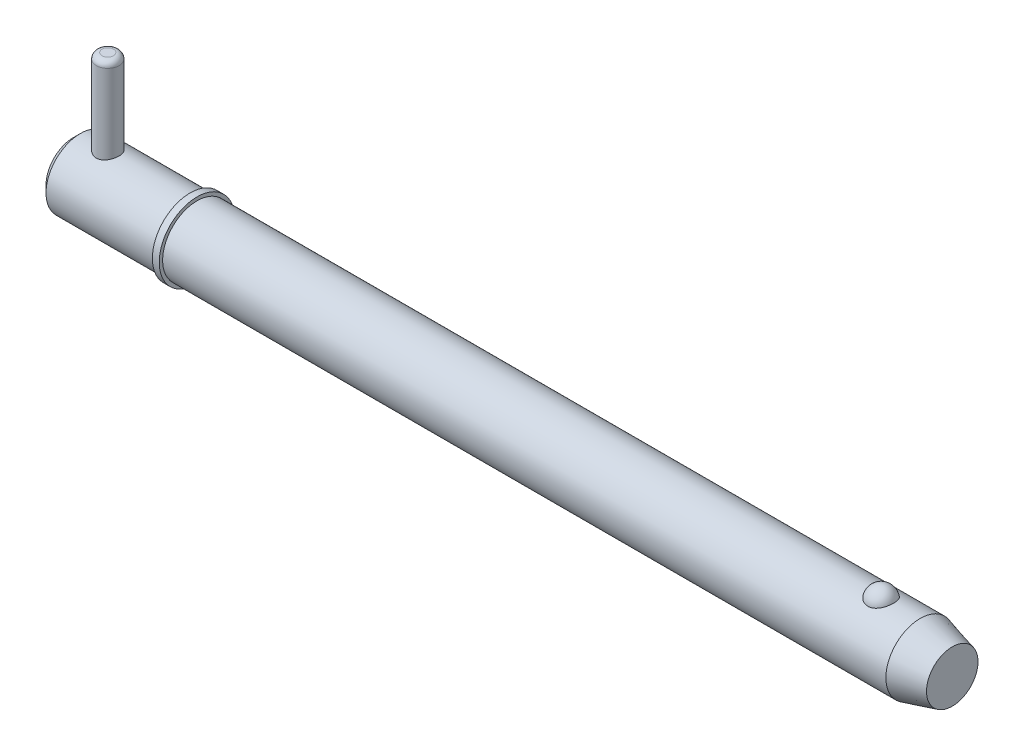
ISO-10303-21;
HEADER;
FILE_DESCRIPTION(('STEP AP214'),'2;1');
FILE_NAME('part.step','',(''),(''),'','','');
FILE_SCHEMA(('AUTOMOTIVE_DESIGN { 1 0 10303 214 1 1 1 1 }'));
ENDSEC;
DATA;
#1=APPLICATION_CONTEXT('core data for automotive mechanical design processes');
#2=APPLICATION_PROTOCOL_DEFINITION('international standard','automotive_design',2000,#1);
#3=PRODUCT_CONTEXT('',#1,'mechanical');
#4=PRODUCT('Part','Part','',(#3));
#5=PRODUCT_RELATED_PRODUCT_CATEGORY('part','',(#4));
#6=PRODUCT_DEFINITION_FORMATION('','',#4);
#7=PRODUCT_DEFINITION_CONTEXT('part definition',#1,'design');
#8=PRODUCT_DEFINITION('design','',#6,#7);
#9=PRODUCT_DEFINITION_SHAPE('','',#8);
#10=(LENGTH_UNIT() NAMED_UNIT(*) SI_UNIT(.MILLI.,.METRE.));
#11=(NAMED_UNIT(*) PLANE_ANGLE_UNIT() SI_UNIT($,.RADIAN.));
#12=(NAMED_UNIT(*) SI_UNIT($,.STERADIAN.) SOLID_ANGLE_UNIT());
#13=UNCERTAINTY_MEASURE_WITH_UNIT(LENGTH_MEASURE(1.E-05),#10,'distance_accuracy_value','');
#14=(GEOMETRIC_REPRESENTATION_CONTEXT(3) GLOBAL_UNCERTAINTY_ASSIGNED_CONTEXT((#13)) GLOBAL_UNIT_ASSIGNED_CONTEXT((#10,
#11,#12)) REPRESENTATION_CONTEXT('',''));
#15=CARTESIAN_POINT('',(0.,0.,0.));
#16=DIRECTION('',(0.,0.,1.));
#17=DIRECTION('',(1.,0.,0.));
#18=AXIS2_PLACEMENT_3D('',#15,#16,#17);
#19=CARTESIAN_POINT('',(7.14,24.605,0.));
#20=DIRECTION('',(0.,-1.,0.));
#21=DIRECTION('',(0.,0.,-1.));
#22=AXIS2_PLACEMENT_3D('',#19,#20,#21);
#23=CYLINDRICAL_SURFACE('',#22,2.38);
#24=CARTESIAN_POINT('',(7.14,-5.955,0.));
#25=DIRECTION('',(0.,1.,0.));
#26=DIRECTION('',(0.,0.,1.));
#27=AXIS2_PLACEMENT_3D('',#24,#25,#26);
#28=CIRCLE('',#27,2.38);
#29=CARTESIAN_POINT('',(7.14,-5.955,2.38));
#30=VERTEX_POINT('',#29);
#31=EDGE_CURVE('P0_E25',#30,#30,#28,.T.);
#32=ORIENTED_EDGE('',*,*,#31,.T.);
#33=EDGE_LOOP('',(#32));
#34=FACE_BOUND('',#33,.T.);
#35=CARTESIAN_POINT('',(7.14,23.415,0.));
#36=DIRECTION('',(0.,1.,0.));
#37=DIRECTION('',(0.,0.,1.));
#38=AXIS2_PLACEMENT_3D('',#35,#36,#37);
#39=CIRCLE('',#38,2.38);
#40=CARTESIAN_POINT('',(7.14,23.415,2.38));
#41=VERTEX_POINT('',#40);
#42=EDGE_CURVE('P0_E29',#41,#41,#39,.F.);
#43=ORIENTED_EDGE('',*,*,#42,.T.);
#44=EDGE_LOOP('',(#43));
#45=FACE_BOUND('',#44,.T.);
#46=ADVANCED_FACE('P0_F14',(#34,#45),#23,.T.);
#47=CARTESIAN_POINT('',(7.14,24.605,0.));
#48=DIRECTION('',(0.,1.,0.));
#49=DIRECTION('',(0.,0.,1.));
#50=AXIS2_PLACEMENT_3D('',#47,#48,#49);
#51=PLANE('',#50);
#52=CARTESIAN_POINT('',(7.14,24.605,0.));
#53=DIRECTION('',(0.,1.,0.));
#54=DIRECTION('',(0.,0.,1.));
#55=AXIS2_PLACEMENT_3D('',#52,#53,#54);
#56=CIRCLE('',#55,1.19);
#57=CARTESIAN_POINT('',(7.14,24.605,1.19));
#58=VERTEX_POINT('',#57);
#59=EDGE_CURVE('P0_E10',#58,#58,#56,.T.);
#60=ORIENTED_EDGE('',*,*,#59,.T.);
#61=EDGE_LOOP('',(#60));
#62=FACE_BOUND('',#61,.T.);
#63=ADVANCED_FACE('P0_F46',(#62),#51,.T.);
#64=CARTESIAN_POINT('',(7.14,-7.145,0.));
#65=DIRECTION('',(0.,1.,0.));
#66=DIRECTION('',(0.,0.,1.));
#67=AXIS2_PLACEMENT_3D('',#64,#65,#66);
#68=PLANE('',#67);
#69=CARTESIAN_POINT('',(7.14,-7.145,0.));
#70=DIRECTION('',(0.,1.,0.));
#71=DIRECTION('',(0.,0.,1.));
#72=AXIS2_PLACEMENT_3D('',#69,#70,#71);
#73=CIRCLE('',#72,1.19);
#74=CARTESIAN_POINT('',(7.14,-7.145,1.19));
#75=VERTEX_POINT('',#74);
#76=EDGE_CURVE('P0_E21',#75,#75,#73,.F.);
#77=ORIENTED_EDGE('',*,*,#76,.T.);
#78=EDGE_LOOP('',(#77));
#79=FACE_BOUND('',#78,.T.);
#80=ADVANCED_FACE('P0_F43',(#79),#68,.F.);
#81=CARTESIAN_POINT('',(7.14,-5.955,0.));
#82=DIRECTION('',(0.,1.,0.));
#83=DIRECTION('',(0.,0.,1.));
#84=AXIS2_PLACEMENT_3D('',#81,#82,#83);
#85=DEGENERATE_TOROIDAL_SURFACE('',#84,1.19,1.19,.T.);
#86=ORIENTED_EDGE('',*,*,#76,.F.);
#87=EDGE_LOOP('',(#86));
#88=FACE_BOUND('',#87,.T.);
#89=ORIENTED_EDGE('',*,*,#31,.F.);
#90=EDGE_LOOP('',(#89));
#91=FACE_BOUND('',#90,.T.);
#92=ADVANCED_FACE('P0_F38',(#88,#91),#85,.T.);
#93=CARTESIAN_POINT('',(7.14,23.415,0.));
#94=DIRECTION('',(0.,1.,0.));
#95=DIRECTION('',(0.,0.,1.));
#96=AXIS2_PLACEMENT_3D('',#93,#94,#95);
#97=DEGENERATE_TOROIDAL_SURFACE('',#96,1.19,1.19,.T.);
#98=ORIENTED_EDGE('',*,*,#42,.F.);
#99=EDGE_LOOP('',(#98));
#100=FACE_BOUND('',#99,.T.);
#101=ORIENTED_EDGE('',*,*,#59,.F.);
#102=EDGE_LOOP('',(#101));
#103=FACE_BOUND('',#102,.T.);
#104=ADVANCED_FACE('P0_F16',(#100,#103),#97,.T.);
#105=CLOSED_SHELL('',(#46,#63,#80,#92,#104));
#106=MANIFOLD_SOLID_BREP('P0_B1',#105);
#107=CARTESIAN_POINT('',(0.,0.,0.));
#108=DIRECTION('',(1.,0.,0.));
#109=DIRECTION('',(0.,0.,-1.));
#110=AXIS2_PLACEMENT_3D('',#107,#108,#109);
#111=CYLINDRICAL_SURFACE('',#110,7.145);
#112=CARTESIAN_POINT('',(176.18362424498,0.,0.));
#113=DIRECTION('',(1.,0.,0.));
#114=DIRECTION('',(0.,0.,-1.));
#115=AXIS2_PLACEMENT_3D('',#112,#113,#114);
#116=CIRCLE('',#115,7.145);
#117=CARTESIAN_POINT('',(176.18362424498,0.,-7.145));
#118=VERTEX_POINT('',#117);
#119=EDGE_CURVE('P1_E81',#118,#118,#116,.T.);
#120=ORIENTED_EDGE('',*,*,#119,.F.);
#121=EDGE_LOOP('',(#120));
#122=FACE_BOUND('',#121,.T.);
#123=CARTESIAN_POINT('',(25.7,0.,0.));
#124=DIRECTION('',(1.,0.,0.));
#125=DIRECTION('',(0.,0.,-1.));
#126=AXIS2_PLACEMENT_3D('',#123,#124,#125);
#127=CIRCLE('',#126,7.145);
#128=CARTESIAN_POINT('',(25.7,0.,-7.145));
#129=VERTEX_POINT('',#128);
#130=EDGE_CURVE('P1_E85',#129,#129,#127,.T.);
#131=ORIENTED_EDGE('',*,*,#130,.T.);
#132=EDGE_LOOP('',(#131));
#133=FACE_BOUND('',#132,.T.);
#134=CARTESIAN_POINT('',(168.039503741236,6.60328629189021,2.72903557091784));
#135=CARTESIAN_POINT('',(167.898315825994,6.60329644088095,2.7290249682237));
#136=CARTESIAN_POINT('',(167.756883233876,6.60799490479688,2.71772840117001));
#137=CARTESIAN_POINT('',(167.477955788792,6.62628236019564,2.6728193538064));
#138=CARTESIAN_POINT('',(167.340472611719,6.63989534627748,2.63914664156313));
#139=CARTESIAN_POINT('',(167.073889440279,6.67440775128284,2.55059642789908));
#140=CARTESIAN_POINT('',(166.944768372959,6.69528793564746,2.49577486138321));
#141=CARTESIAN_POINT('',(166.697869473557,6.74205585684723,2.36651799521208));
#142=CARTESIAN_POINT('',(166.580086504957,6.76794130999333,2.2920916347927));
#143=CARTESIAN_POINT('',(166.35516710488,6.82286177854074,2.12312937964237));
#144=CARTESIAN_POINT('',(166.248440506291,6.85196655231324,2.0280710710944));
#145=CARTESIAN_POINT('',(166.051918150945,6.90970232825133,1.82167822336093));
#146=CARTESIAN_POINT('',(165.962127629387,6.93833318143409,1.71033867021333));
#147=CARTESIAN_POINT('',(165.797667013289,6.9935167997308,1.46891951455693));
#148=CARTESIAN_POINT('',(165.723844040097,7.01992110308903,1.33822781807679));
#149=CARTESIAN_POINT('',(165.598088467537,7.06643385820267,1.0656656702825));
#150=CARTESIAN_POINT('',(165.54615735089,7.08654188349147,0.923794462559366));
#151=CARTESIAN_POINT('',(165.464732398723,7.11862399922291,0.630993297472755));
#152=CARTESIAN_POINT('',(165.435516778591,7.13049704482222,0.479974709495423));
#153=CARTESIAN_POINT('',(165.401174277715,7.14449484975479,0.174782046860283));
#154=CARTESIAN_POINT('',(165.396046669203,7.14661990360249,0.020608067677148));
#155=CARTESIAN_POINT('',(165.409938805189,7.14092465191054,-0.285506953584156));
#156=CARTESIAN_POINT('',(165.428810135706,7.1331654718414,-0.437455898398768));
#157=CARTESIAN_POINT('',(165.490062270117,7.10859076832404,-0.73577860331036));
#158=CARTESIAN_POINT('',(165.532443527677,7.0917750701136,-0.882152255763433));
#159=CARTESIAN_POINT('',(165.639934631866,7.05076716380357,-1.16543149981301));
#160=CARTESIAN_POINT('',(165.705075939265,7.02656475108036,-1.30232366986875));
#161=CARTESIAN_POINT('',(165.856759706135,6.97329145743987,-1.56265907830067));
#162=CARTESIAN_POINT('',(165.943303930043,6.94422017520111,-1.68610120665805));
#163=CARTESIAN_POINT('',(166.136465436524,6.88415108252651,-1.91671004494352));
#164=CARTESIAN_POINT('',(166.243180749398,6.85314438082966,-2.02379244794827));
#165=CARTESIAN_POINT('',(166.473974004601,6.79282069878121,-2.21787433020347));
#166=CARTESIAN_POINT('',(166.598050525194,6.76350358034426,-2.30487545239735));
#167=CARTESIAN_POINT('',(166.857678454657,6.71060580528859,-2.45458647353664));
#168=CARTESIAN_POINT('',(166.992938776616,6.68691885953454,-2.51776240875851));
#169=CARTESIAN_POINT('',(167.273277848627,6.64741247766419,-2.62030218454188));
#170=CARTESIAN_POINT('',(167.418352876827,6.63159007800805,-2.65967499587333));
#171=CARTESIAN_POINT('',(167.706347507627,6.61038594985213,-2.71193301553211));
#172=CARTESIAN_POINT('',(167.84900807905,6.60451880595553,-2.72605165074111));
#173=CARTESIAN_POINT('',(168.13480047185,6.60240611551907,-2.73116688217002));
#174=CARTESIAN_POINT('',(168.277932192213,6.60615862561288,-2.7221681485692));
#175=CARTESIAN_POINT('',(168.555848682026,6.62256094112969,-2.68200435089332));
#176=CARTESIAN_POINT('',(168.690754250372,6.63492533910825,-2.65154998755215));
#177=CARTESIAN_POINT('',(168.95332009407,6.66687445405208,-2.57015684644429));
#178=CARTESIAN_POINT('',(169.08097978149,6.68645975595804,-2.51921640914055));
#179=CARTESIAN_POINT('',(169.328577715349,6.73127274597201,-2.39693610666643));
#180=CARTESIAN_POINT('',(169.448287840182,6.7566138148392,-2.32517694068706));
#181=CARTESIAN_POINT('',(169.674159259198,6.8100600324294,-2.16363812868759));
#182=CARTESIAN_POINT('',(169.780317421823,6.83816581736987,-2.07385432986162));
#183=CARTESIAN_POINT('',(169.981862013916,6.89580469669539,-1.87357235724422));
#184=CARTESIAN_POINT('',(170.076440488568,6.92533863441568,-1.76226074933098));
#185=CARTESIAN_POINT('',(170.246332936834,6.98139526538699,-1.5251169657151));
#186=CARTESIAN_POINT('',(170.321643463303,7.0079174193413,-1.39928219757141));
#187=CARTESIAN_POINT('',(170.453595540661,7.05607625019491,-1.1321597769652));
#188=CARTESIAN_POINT('',(170.509568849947,7.07753119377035,-0.990508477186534));
#189=CARTESIAN_POINT('',(170.598296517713,7.11222355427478,-0.699154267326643));
#190=CARTESIAN_POINT('',(170.631050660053,7.12546089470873,-0.549451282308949));
#191=CARTESIAN_POINT('',(170.672689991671,7.14237584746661,-0.246120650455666));
#192=CARTESIAN_POINT('',(170.681558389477,7.14604673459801,-0.0924903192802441));
#193=CARTESIAN_POINT('',(170.675194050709,7.14343510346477,0.214181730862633));
#194=CARTESIAN_POINT('',(170.659961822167,7.13715279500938,0.367223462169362));
#195=CARTESIAN_POINT('',(170.605845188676,7.1153294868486,0.667595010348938));
#196=CARTESIAN_POINT('',(170.567077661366,7.09983424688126,0.814949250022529));
#197=CARTESIAN_POINT('',(170.466770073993,7.06119140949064,1.1006322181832));
#198=CARTESIAN_POINT('',(170.405228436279,7.03804328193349,1.23896032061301));
#199=CARTESIAN_POINT('',(170.260207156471,6.98632429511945,1.50352300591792));
#200=CARTESIAN_POINT('',(170.176606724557,6.95772382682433,1.62968561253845));
#201=CARTESIAN_POINT('',(169.98938046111,6.89823072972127,1.86554304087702));
#202=CARTESIAN_POINT('',(169.885755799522,6.86733823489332,1.97523882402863));
#203=CARTESIAN_POINT('',(169.661076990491,6.80676456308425,2.174822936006));
#204=CARTESIAN_POINT('',(169.540067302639,6.7770805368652,2.26476035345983));
#205=CARTESIAN_POINT('',(169.283340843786,6.7223050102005,2.42252989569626));
#206=CARTESIAN_POINT('',(169.14761851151,6.69721525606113,2.4903536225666));
#207=CARTESIAN_POINT('',(168.870402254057,6.65552591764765,2.59967646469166));
#208=CARTESIAN_POINT('',(168.729281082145,6.63865794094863,2.6420201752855));
#209=CARTESIAN_POINT('',(168.441444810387,6.61425039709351,2.70255841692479));
#210=CARTESIAN_POINT('',(168.294748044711,6.606682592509,2.72082606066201));
#211=CARTESIAN_POINT('',(168.111679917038,6.60358754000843,2.72830331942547));
#212=CARTESIAN_POINT('',(168.075599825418,6.60328369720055,2.72903828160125));
#213=CARTESIAN_POINT('',(168.039503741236,6.60328629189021,2.72903557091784));
#214=B_SPLINE_CURVE_WITH_KNOTS('',3,(#134,#135,#136,#137,#138,#139,#140,#141,#142,#143,#144,
#145,#146,#147,#148,#149,#150,#151,#152,#153,#154,#155,#156,#157,#158,#159,#160,#161,#162,#163,
#164,#165,#166,#167,#168,#169,#170,#171,#172,#173,#174,#175,#176,#177,#178,#179,#180,#181,#182,
#183,#184,#185,#186,#187,#188,#189,#190,#191,#192,#193,#194,#195,#196,#197,#198,#199,#200,#201,
#202,#203,#204,#205,#206,#207,#208,#209,#210,#211,#212,#213),.UNSPECIFIED.,.T.,.F.,(4,2,2,2,2,2,
2,2,2,2,2,2,2,2,2,2,2,2,2,2,2,2,2,2,2,2,2,2,2,2,2,2,2,2,2,2,2,2,2,4),(0.,0.423468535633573,
0.848081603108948,1.27157926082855,1.69488414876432,2.13051395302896,2.56627819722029,
3.02136706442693,3.47648674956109,3.93709649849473,4.39769233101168,4.85545355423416,
5.31322361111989,5.77162895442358,6.23007210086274,6.6908033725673,7.15149693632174,
7.60264329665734,8.05361952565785,8.48189729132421,8.91008854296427,9.32472524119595,
9.73939553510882,10.1630783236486,10.5868588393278,11.0319070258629,11.4770347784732,
11.9362874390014,12.3955443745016,12.8551240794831,13.3146940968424,13.7720003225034,
14.2293382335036,14.6892343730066,15.1491036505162,15.6078171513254,16.0667046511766,
16.5093965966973,16.9507410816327,17.0590049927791),.UNSPECIFIED.);
#215=CARTESIAN_POINT('',(168.039503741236,6.60328629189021,2.72903557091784));
#216=VERTEX_POINT('',#215);
#217=EDGE_CURVE('P1_E35',#216,#216,#214,.T.);
#218=ORIENTED_EDGE('',*,*,#217,.T.);
#219=EDGE_LOOP('',(#218));
#220=FACE_BOUND('',#219,.T.);
#221=ADVANCED_FACE('P1_F13',(#122,#133,#220),#111,.T.);
#222=CARTESIAN_POINT('',(0.,0.,0.));
#223=DIRECTION('',(-1.,0.,0.));
#224=DIRECTION('',(0.,0.,1.));
#225=AXIS2_PLACEMENT_3D('',#222,#223,#224);
#226=PLANE('',#225);
#227=CARTESIAN_POINT('',(0.,0.,0.));
#228=DIRECTION('',(1.,0.,0.));
#229=DIRECTION('',(0.,0.,-1.));
#230=AXIS2_PLACEMENT_3D('',#227,#228,#229);
#231=CIRCLE('',#230,5.716);
#232=CARTESIAN_POINT('',(0.,0.,-5.716));
#233=VERTEX_POINT('',#232);
#234=EDGE_CURVE('P1_E9',#233,#233,#231,.T.);
#235=ORIENTED_EDGE('',*,*,#234,.F.);
#236=EDGE_LOOP('',(#235));
#237=FACE_BOUND('',#236,.T.);
#238=ADVANCED_FACE('P1_F15',(#237),#226,.T.);
#239=CARTESIAN_POINT('',(1.42899999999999,0.,0.));
#240=DIRECTION('',(1.,0.,0.));
#241=DIRECTION('',(0.,0.,-1.));
#242=AXIS2_PLACEMENT_3D('',#239,#240,#241);
#243=CONICAL_SURFACE('',#242,7.145,0.78539816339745);
#244=ORIENTED_EDGE('',*,*,#234,.T.);
#245=EDGE_LOOP('',(#244));
#246=FACE_BOUND('',#245,.T.);
#247=CARTESIAN_POINT('',(1.42899999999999,0.,0.));
#248=DIRECTION('',(1.,0.,0.));
#249=DIRECTION('',(0.,0.,-1.));
#250=AXIS2_PLACEMENT_3D('',#247,#248,#249);
#251=CIRCLE('',#250,7.145);
#252=CARTESIAN_POINT('',(1.42899999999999,0.,-7.145));
#253=VERTEX_POINT('',#252);
#254=EDGE_CURVE('P1_E26',#253,#253,#251,.T.);
#255=ORIENTED_EDGE('',*,*,#254,.F.);
#256=EDGE_LOOP('',(#255));
#257=FACE_BOUND('',#256,.T.);
#258=ADVANCED_FACE('P1_F77',(#246,#257),#243,.T.);
#259=CARTESIAN_POINT('',(0.,0.,0.));
#260=DIRECTION('',(1.,0.,0.));
#261=DIRECTION('',(0.,0.,-1.));
#262=AXIS2_PLACEMENT_3D('',#259,#260,#261);
#263=CYLINDRICAL_SURFACE('',#262,7.145);
#264=CARTESIAN_POINT('',(7.14,-6.73695962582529,2.38));
#265=CARTESIAN_POINT('',(7.01035997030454,-6.73695921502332,2.38000059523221));
#266=CARTESIAN_POINT('',(6.88072348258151,-6.74074253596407,2.36937183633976));
#267=CARTESIAN_POINT('',(6.62529075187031,-6.75538853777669,2.32728080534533));
#268=CARTESIAN_POINT('',(6.49949514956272,-6.76625239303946,2.29581507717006));
#269=CARTESIAN_POINT('',(6.2554858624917,-6.79369535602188,2.21327763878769));
#270=CARTESIAN_POINT('',(6.13725786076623,-6.81026326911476,2.16224430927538));
#271=CARTESIAN_POINT('',(5.91100349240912,-6.84723128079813,2.04215132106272));
#272=CARTESIAN_POINT('',(5.80297937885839,-6.86763222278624,1.97308769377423));
#273=CARTESIAN_POINT('',(5.59597854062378,-6.91086152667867,1.81600414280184));
#274=CARTESIAN_POINT('',(5.49745861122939,-6.93375032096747,1.72739874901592));
#275=CARTESIAN_POINT('',(5.31636508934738,-6.97886546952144,1.53499636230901));
#276=CARTESIAN_POINT('',(5.23379405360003,-7.00109171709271,1.43119693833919));
#277=CARTESIAN_POINT('',(5.08487013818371,-7.04307708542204,1.20801318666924));
#278=CARTESIAN_POINT('',(5.01899578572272,-7.06275685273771,1.08829330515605));
#279=CARTESIAN_POINT('',(4.90850130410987,-7.09671988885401,0.838703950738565));
#280=CARTESIAN_POINT('',(4.86387545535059,-7.11100460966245,0.70883722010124));
#281=CARTESIAN_POINT('',(4.79869354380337,-7.13213998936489,0.44742990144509));
#282=CARTESIAN_POINT('',(4.77735497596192,-7.13923172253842,0.316104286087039));
#283=CARTESIAN_POINT('',(4.75686536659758,-7.14603777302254,0.0515578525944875));
#284=CARTESIAN_POINT('',(4.75770861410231,-7.14575398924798,-0.0816624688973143));
#285=CARTESIAN_POINT('',(4.78106216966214,-7.13800438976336,-0.340678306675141));
#286=CARTESIAN_POINT('',(4.80272255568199,-7.13082030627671,-0.466560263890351));
#287=CARTESIAN_POINT('',(4.86569013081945,-7.11043095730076,-0.712788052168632));
#288=CARTESIAN_POINT('',(4.90699865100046,-7.09722528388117,-0.833133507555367));
#289=CARTESIAN_POINT('',(5.00858673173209,-7.06591754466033,-1.06673173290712));
#290=CARTESIAN_POINT('',(5.06910834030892,-7.0477534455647,-1.17987058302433));
#291=CARTESIAN_POINT('',(5.20720514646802,-7.00841977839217,-1.39463797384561));
#292=CARTESIAN_POINT('',(5.28478508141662,-6.987249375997,-1.49626330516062));
#293=CARTESIAN_POINT('',(5.4590800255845,-6.94296010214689,-1.69017445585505));
#294=CARTESIAN_POINT('',(5.55652324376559,-6.91979641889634,-1.78179645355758));
#295=CARTESIAN_POINT('',(5.76558873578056,-6.87497076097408,-1.94761348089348));
#296=CARTESIAN_POINT('',(5.87721318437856,-6.85330901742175,-2.02180583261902));
#297=CARTESIAN_POINT('',(6.11357367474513,-6.81369485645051,-2.15157488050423));
#298=CARTESIAN_POINT('',(6.23847358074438,-6.79579956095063,-2.20687188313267));
#299=CARTESIAN_POINT('',(6.49655785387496,-6.76640630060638,-2.29542443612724));
#300=CARTESIAN_POINT('',(6.62973872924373,-6.75490565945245,-2.32868920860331));
#301=CARTESIAN_POINT('',(6.89417536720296,-6.74020933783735,-2.37088225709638));
#302=CARTESIAN_POINT('',(7.02524746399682,-6.73666278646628,-2.38083959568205));
#303=CARTESIAN_POINT('',(7.28721035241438,-6.73729555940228,-2.37904974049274));
#304=CARTESIAN_POINT('',(7.41810117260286,-6.7414734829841,-2.36730648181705));
#305=CARTESIAN_POINT('',(7.67130717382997,-6.75673471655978,-2.32337336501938));
#306=CARTESIAN_POINT('',(7.79376251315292,-6.76757635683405,-2.29189834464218));
#307=CARTESIAN_POINT('',(8.03162917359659,-6.79467771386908,-2.21025275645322));
#308=CARTESIAN_POINT('',(8.14703924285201,-6.8109383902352,-2.16007887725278));
#309=CARTESIAN_POINT('',(8.37159169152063,-6.84768362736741,-2.04065289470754));
#310=CARTESIAN_POINT('',(8.48041962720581,-6.86828569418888,-1.97084668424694));
#311=CARTESIAN_POINT('',(8.68518919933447,-6.91116416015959,-1.8147657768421));
#312=CARTESIAN_POINT('',(8.78112702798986,-6.93344105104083,-1.72848623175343));
#313=CARTESIAN_POINT('',(8.96215574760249,-6.97845348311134,-1.53698616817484));
#314=CARTESIAN_POINT('',(9.04650427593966,-7.00115965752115,-1.43105491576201));
#315=CARTESIAN_POINT('',(9.19627592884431,-7.04341676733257,-1.20598377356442));
#316=CARTESIAN_POINT('',(9.26169972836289,-7.06296781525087,-1.08684435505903));
#317=CARTESIAN_POINT('',(9.37116617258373,-7.0966205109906,-0.83933303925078));
#318=CARTESIAN_POINT('',(9.41534821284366,-7.11075755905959,-0.711027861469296));
#319=CARTESIAN_POINT('',(9.48132660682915,-7.13214194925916,-0.448245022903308));
#320=CARTESIAN_POINT('',(9.50313102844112,-7.13939177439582,-0.313769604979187));
#321=CARTESIAN_POINT('',(9.5230098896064,-7.14599771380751,-0.049254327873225));
#322=CARTESIAN_POINT('',(9.52215013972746,-7.14570837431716,0.0806974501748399));
#323=CARTESIAN_POINT('',(9.49935359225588,-7.13814116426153,0.338518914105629));
#324=CARTESIAN_POINT('',(9.47741850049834,-7.13086385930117,0.466388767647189));
#325=CARTESIAN_POINT('',(9.4138005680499,-7.11026814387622,0.714400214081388));
#326=CARTESIAN_POINT('',(9.37243609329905,-7.09704726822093,0.834632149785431));
#327=CARTESIAN_POINT('',(9.27142829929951,-7.06592602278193,1.06649582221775));
#328=CARTESIAN_POINT('',(9.2117816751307,-7.04802480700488,1.1781259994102));
#329=CARTESIAN_POINT('',(9.07336776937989,-7.00856499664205,1.39411030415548));
#330=CARTESIAN_POINT('',(8.99397590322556,-6.98689577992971,1.49804368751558));
#331=CARTESIAN_POINT('',(8.81938810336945,-6.9426110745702,1.69146078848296));
#332=CARTESIAN_POINT('',(8.72418713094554,-6.91999528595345,1.78093988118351));
#333=CARTESIAN_POINT('',(8.51623540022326,-6.87531507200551,1.94646188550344));
#334=CARTESIAN_POINT('',(8.4029442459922,-6.85330672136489,2.02184316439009));
#335=CARTESIAN_POINT('',(8.16461714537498,-6.81342065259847,2.1524427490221));
#336=CARTESIAN_POINT('',(8.03958429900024,-6.7955418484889,2.20766635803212));
#337=CARTESIAN_POINT('',(7.78712566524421,-6.76686117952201,2.29403636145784));
#338=CARTESIAN_POINT('',(7.66006989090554,-6.75577342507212,2.32616709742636));
#339=CARTESIAN_POINT('',(7.40200728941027,-6.74082409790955,2.36914495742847));
#340=CARTESIAN_POINT('',(7.27100183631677,-6.73696004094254,2.37999939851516));
#341=CARTESIAN_POINT('',(7.14,-6.73695962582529,2.38));
#342=B_SPLINE_CURVE_WITH_KNOTS('',3,(#264,#265,#266,#267,#268,#269,#270,#271,#272,#273,#274,
#275,#276,#277,#278,#279,#280,#281,#282,#283,#284,#285,#286,#287,#288,#289,#290,#291,#292,#293,
#294,#295,#296,#297,#298,#299,#300,#301,#302,#303,#304,#305,#306,#307,#308,#309,#310,#311,#312,
#313,#314,#315,#316,#317,#318,#319,#320,#321,#322,#323,#324,#325,#326,#327,#328,#329,#330,#331,
#332,#333,#334,#335,#336,#337,#338,#339,#340,#341),.UNSPECIFIED.,.T.,.F.,(4,2,2,2,2,2,2,2,2,2,2,
2,2,2,2,2,2,2,2,2,2,2,2,2,2,2,2,2,2,2,2,2,2,2,2,2,2,2,4),(0.,0.388434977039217,
0.776934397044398,1.16467566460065,1.55250234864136,1.9540847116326,2.35573139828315,
2.76784120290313,3.17984001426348,3.57752248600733,3.97510257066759,4.35711073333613,
4.7391447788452,5.12619663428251,5.51335611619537,5.91871976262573,6.3241456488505,
6.73533623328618,7.14635459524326,7.53885245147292,7.93127914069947,8.31025106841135,
8.68929014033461,9.08033871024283,9.47150254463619,9.88145528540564,10.2913934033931,
10.6986033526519,11.1056664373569,11.4936225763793,11.8815473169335,12.2633262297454,
12.645174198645,13.0411187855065,13.437189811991,13.8487371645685,14.2601761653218,
14.6528265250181,15.0453418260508),.UNSPECIFIED.);
#343=CARTESIAN_POINT('',(7.14,-6.73695962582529,2.38));
#344=VERTEX_POINT('',#343);
#345=EDGE_CURVE('P1_E17',#344,#344,#342,.T.);
#346=ORIENTED_EDGE('',*,*,#345,.F.);
#347=EDGE_LOOP('',(#346));
#348=FACE_BOUND('',#347,.T.);
#349=CARTESIAN_POINT('',(7.14,6.73695962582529,2.38));
#350=CARTESIAN_POINT('',(7.26964002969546,6.73695921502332,2.38000059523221));
#351=CARTESIAN_POINT('',(7.39927651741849,6.74074253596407,2.36937183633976));
#352=CARTESIAN_POINT('',(7.65470924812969,6.75538853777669,2.32728080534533));
#353=CARTESIAN_POINT('',(7.78050485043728,6.76625239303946,2.29581507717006));
#354=CARTESIAN_POINT('',(8.02451413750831,6.79369535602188,2.21327763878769));
#355=CARTESIAN_POINT('',(8.14274213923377,6.81026326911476,2.16224430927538));
#356=CARTESIAN_POINT('',(8.36899650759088,6.84723128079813,2.04215132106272));
#357=CARTESIAN_POINT('',(8.47702062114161,6.86763222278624,1.97308769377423));
#358=CARTESIAN_POINT('',(8.68402145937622,6.91086152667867,1.81600414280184));
#359=CARTESIAN_POINT('',(8.78254138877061,6.93375032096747,1.72739874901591));
#360=CARTESIAN_POINT('',(8.96363491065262,6.97886546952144,1.53499636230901));
#361=CARTESIAN_POINT('',(9.04620594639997,7.00109171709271,1.43119693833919));
#362=CARTESIAN_POINT('',(9.19512986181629,7.04307708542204,1.20801318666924));
#363=CARTESIAN_POINT('',(9.26100421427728,7.06275685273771,1.08829330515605));
#364=CARTESIAN_POINT('',(9.37149869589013,7.09671988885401,0.838703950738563));
#365=CARTESIAN_POINT('',(9.41612454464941,7.11100460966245,0.708837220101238));
#366=CARTESIAN_POINT('',(9.48130645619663,7.13213998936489,0.447429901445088));
#367=CARTESIAN_POINT('',(9.50264502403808,7.13923172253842,0.316104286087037));
#368=CARTESIAN_POINT('',(9.52313463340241,7.14603777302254,0.0515578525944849));
#369=CARTESIAN_POINT('',(9.52229138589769,7.14575398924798,-0.0816624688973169));
#370=CARTESIAN_POINT('',(9.49893783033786,7.13800438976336,-0.340678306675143));
#371=CARTESIAN_POINT('',(9.47727744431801,7.13082030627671,-0.466560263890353));
#372=CARTESIAN_POINT('',(9.41430986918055,7.11043095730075,-0.712788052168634));
#373=CARTESIAN_POINT('',(9.37300134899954,7.09722528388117,-0.833133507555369));
#374=CARTESIAN_POINT('',(9.27141326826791,7.06591754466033,-1.06673173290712));
#375=CARTESIAN_POINT('',(9.21089165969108,7.0477534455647,-1.17987058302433));
#376=CARTESIAN_POINT('',(9.07279485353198,7.00841977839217,-1.39463797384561));
#377=CARTESIAN_POINT('',(8.99521491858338,6.987249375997,-1.49626330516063));
#378=CARTESIAN_POINT('',(8.82091997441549,6.94296010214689,-1.69017445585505));
#379=CARTESIAN_POINT('',(8.72347675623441,6.91979641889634,-1.78179645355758));
#380=CARTESIAN_POINT('',(8.51441126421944,6.87497076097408,-1.94761348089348));
#381=CARTESIAN_POINT('',(8.40278681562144,6.85330901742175,-2.02180583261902));
#382=CARTESIAN_POINT('',(8.16642632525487,6.81369485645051,-2.15157488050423));
#383=CARTESIAN_POINT('',(8.04152641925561,6.79579956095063,-2.20687188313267));
#384=CARTESIAN_POINT('',(7.78344214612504,6.76640630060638,-2.29542443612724));
#385=CARTESIAN_POINT('',(7.65026127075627,6.75490565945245,-2.32868920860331));
#386=CARTESIAN_POINT('',(7.38582463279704,6.74020933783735,-2.37088225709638));
#387=CARTESIAN_POINT('',(7.25475253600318,6.73666278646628,-2.38083959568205));
#388=CARTESIAN_POINT('',(6.99278964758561,6.73729555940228,-2.37904974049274));
#389=CARTESIAN_POINT('',(6.86189882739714,6.7414734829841,-2.36730648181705));
#390=CARTESIAN_POINT('',(6.60869282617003,6.75673471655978,-2.32337336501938));
#391=CARTESIAN_POINT('',(6.48623748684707,6.76757635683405,-2.29189834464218));
#392=CARTESIAN_POINT('',(6.2483708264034,6.79467771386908,-2.21025275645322));
#393=CARTESIAN_POINT('',(6.13296075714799,6.8109383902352,-2.16007887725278));
#394=CARTESIAN_POINT('',(5.90840830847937,6.84768362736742,-2.04065289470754));
#395=CARTESIAN_POINT('',(5.79958037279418,6.86828569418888,-1.97084668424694));
#396=CARTESIAN_POINT('',(5.59481080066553,6.91116416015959,-1.8147657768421));
#397=CARTESIAN_POINT('',(5.49887297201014,6.93344105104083,-1.72848623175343));
#398=CARTESIAN_POINT('',(5.31784425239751,6.97845348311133,-1.53698616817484));
#399=CARTESIAN_POINT('',(5.23349572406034,7.00115965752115,-1.43105491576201));
#400=CARTESIAN_POINT('',(5.08372407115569,7.04341676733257,-1.20598377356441));
#401=CARTESIAN_POINT('',(5.01830027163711,7.06296781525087,-1.08684435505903));
#402=CARTESIAN_POINT('',(4.90883382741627,7.0966205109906,-0.839333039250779));
#403=CARTESIAN_POINT('',(4.86465178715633,7.11075755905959,-0.711027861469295));
#404=CARTESIAN_POINT('',(4.79867339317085,7.13214194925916,-0.448245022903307));
#405=CARTESIAN_POINT('',(4.77686897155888,7.13939177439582,-0.313769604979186));
#406=CARTESIAN_POINT('',(4.7569901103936,7.14599771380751,-0.0492543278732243));
#407=CARTESIAN_POINT('',(4.75784986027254,7.14570837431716,0.0806974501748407));
#408=CARTESIAN_POINT('',(4.78064640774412,7.13814116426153,0.33851891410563));
#409=CARTESIAN_POINT('',(4.80258149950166,7.13086385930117,0.46638876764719));
#410=CARTESIAN_POINT('',(4.8661994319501,7.11026814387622,0.714400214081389));
#411=CARTESIAN_POINT('',(4.90756390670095,7.09704726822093,0.834632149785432));
#412=CARTESIAN_POINT('',(5.00857170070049,7.06592602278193,1.06649582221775));
#413=CARTESIAN_POINT('',(5.0682183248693,7.04802480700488,1.1781259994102));
#414=CARTESIAN_POINT('',(5.20663223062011,7.00856499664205,1.39411030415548));
#415=CARTESIAN_POINT('',(5.28602409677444,6.98689577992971,1.49804368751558));
#416=CARTESIAN_POINT('',(5.46061189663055,6.9426110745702,1.69146078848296));
#417=CARTESIAN_POINT('',(5.55581286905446,6.91999528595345,1.78093988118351));
#418=CARTESIAN_POINT('',(5.76376459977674,6.87531507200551,1.94646188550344));
#419=CARTESIAN_POINT('',(5.8770557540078,6.85330672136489,2.02184316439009));
#420=CARTESIAN_POINT('',(6.11538285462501,6.81342065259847,2.1524427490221));
#421=CARTESIAN_POINT('',(6.24041570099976,6.7955418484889,2.20766635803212));
#422=CARTESIAN_POINT('',(6.4928743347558,6.76686117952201,2.29403636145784));
#423=CARTESIAN_POINT('',(6.61993010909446,6.75577342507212,2.32616709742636));
#424=CARTESIAN_POINT('',(6.87799271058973,6.74082409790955,2.36914495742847));
#425=CARTESIAN_POINT('',(7.00899816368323,6.73696004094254,2.37999939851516));
#426=CARTESIAN_POINT('',(7.14,6.73695962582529,2.38));
#427=B_SPLINE_CURVE_WITH_KNOTS('',3,(#349,#350,#351,#352,#353,#354,#355,#356,#357,#358,#359,
#360,#361,#362,#363,#364,#365,#366,#367,#368,#369,#370,#371,#372,#373,#374,#375,#376,#377,#378,
#379,#380,#381,#382,#383,#384,#385,#386,#387,#388,#389,#390,#391,#392,#393,#394,#395,#396,#397,
#398,#399,#400,#401,#402,#403,#404,#405,#406,#407,#408,#409,#410,#411,#412,#413,#414,#415,#416,
#417,#418,#419,#420,#421,#422,#423,#424,#425,#426),.UNSPECIFIED.,.T.,.F.,(4,2,2,2,2,2,2,2,2,2,2,
2,2,2,2,2,2,2,2,2,2,2,2,2,2,2,2,2,2,2,2,2,2,2,2,2,2,2,4),(0.,0.388434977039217,
0.776934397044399,1.16467566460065,1.55250234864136,1.9540847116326,2.35573139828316,
2.76784120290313,3.17984001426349,3.57752248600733,3.97510257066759,4.35711073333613,
4.73914477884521,5.12619663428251,5.51335611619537,5.91871976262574,6.3241456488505,
6.73533623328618,7.14635459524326,7.53885245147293,7.93127914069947,8.31025106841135,
8.68929014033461,9.08033871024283,9.47150254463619,9.88145528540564,10.2913934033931,
10.6986033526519,11.1056664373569,11.4936225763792,11.8815473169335,12.2633262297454,
12.645174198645,13.0411187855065,13.437189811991,13.8487371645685,14.2601761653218,
14.6528265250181,15.0453418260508),.UNSPECIFIED.);
#428=CARTESIAN_POINT('',(7.14,6.73695962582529,2.38));
#429=VERTEX_POINT('',#428);
#430=EDGE_CURVE('P1_E43',#429,#429,#427,.T.);
#431=ORIENTED_EDGE('',*,*,#430,.F.);
#432=EDGE_LOOP('',(#431));
#433=FACE_BOUND('',#432,.T.);
#434=ORIENTED_EDGE('',*,*,#254,.T.);
#435=EDGE_LOOP('',(#434));
#436=FACE_BOUND('',#435,.T.);
#437=CARTESIAN_POINT('',(24.271,0.,0.));
#438=DIRECTION('',(1.,0.,0.));
#439=DIRECTION('',(0.,0.,-1.));
#440=AXIS2_PLACEMENT_3D('',#437,#438,#439);
#441=CIRCLE('',#440,7.145);
#442=CARTESIAN_POINT('',(24.271,0.,-7.145));
#443=VERTEX_POINT('',#442);
#444=EDGE_CURVE('P1_E31',#443,#443,#441,.T.);
#445=ORIENTED_EDGE('',*,*,#444,.F.);
#446=EDGE_LOOP('',(#445));
#447=FACE_BOUND('',#446,.T.);
#448=ADVANCED_FACE('P1_F103',(#348,#433,#436,#447),#263,.T.);
#449=CARTESIAN_POINT('',(24.271,7.145,0.));
#450=DIRECTION('',(-1.,0.,0.));
#451=DIRECTION('',(0.,0.,1.));
#452=AXIS2_PLACEMENT_3D('',#449,#450,#451);
#453=PLANE('',#452);
#454=ORIENTED_EDGE('',*,*,#444,.T.);
#455=EDGE_LOOP('',(#454));
#456=FACE_BOUND('',#455,.T.);
#457=CARTESIAN_POINT('',(24.271,0.,0.));
#458=DIRECTION('',(1.,0.,0.));
#459=DIRECTION('',(0.,0.,-1.));
#460=AXIS2_PLACEMENT_3D('',#457,#458,#459);
#461=CIRCLE('',#460,7.8595);
#462=CARTESIAN_POINT('',(24.271,0.,-7.8595));
#463=VERTEX_POINT('',#462);
#464=EDGE_CURVE('P1_E91',#463,#463,#461,.T.);
#465=ORIENTED_EDGE('',*,*,#464,.F.);
#466=EDGE_LOOP('',(#465));
#467=FACE_BOUND('',#466,.T.);
#468=ADVANCED_FACE('P1_F100',(#456,#467),#453,.T.);
#469=CARTESIAN_POINT('',(0.,0.,0.));
#470=DIRECTION('',(1.,0.,0.));
#471=DIRECTION('',(0.,0.,-1.));
#472=AXIS2_PLACEMENT_3D('',#469,#470,#471);
#473=CYLINDRICAL_SURFACE('',#472,7.8595);
#474=ORIENTED_EDGE('',*,*,#464,.T.);
#475=EDGE_LOOP('',(#474));
#476=FACE_BOUND('',#475,.T.);
#477=CARTESIAN_POINT('',(25.7,0.,0.));
#478=DIRECTION('',(1.,0.,0.));
#479=DIRECTION('',(0.,0.,-1.));
#480=AXIS2_PLACEMENT_3D('',#477,#478,#479);
#481=CIRCLE('',#480,7.8595);
#482=CARTESIAN_POINT('',(25.7,0.,-7.8595));
#483=VERTEX_POINT('',#482);
#484=EDGE_CURVE('P1_E88',#483,#483,#481,.T.);
#485=ORIENTED_EDGE('',*,*,#484,.F.);
#486=EDGE_LOOP('',(#485));
#487=FACE_BOUND('',#486,.T.);
#488=ADVANCED_FACE('P1_F68',(#476,#487),#473,.T.);
#489=CARTESIAN_POINT('',(25.7,7.8595,0.));
#490=DIRECTION('',(1.,0.,0.));
#491=DIRECTION('',(0.,0.,-1.));
#492=AXIS2_PLACEMENT_3D('',#489,#490,#491);
#493=PLANE('',#492);
#494=ORIENTED_EDGE('',*,*,#484,.T.);
#495=EDGE_LOOP('',(#494));
#496=FACE_BOUND('',#495,.T.);
#497=ORIENTED_EDGE('',*,*,#130,.F.);
#498=EDGE_LOOP('',(#497));
#499=FACE_BOUND('',#498,.T.);
#500=ADVANCED_FACE('P1_F62',(#496,#499),#493,.T.);
#501=CARTESIAN_POINT('',(182.85,0.,0.));
#502=DIRECTION('',(-1.,0.,0.));
#503=DIRECTION('',(0.,0.,1.));
#504=AXIS2_PLACEMENT_3D('',#501,#502,#503);
#505=CONICAL_SURFACE('',#504,5.35875000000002,0.261799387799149);
#506=ORIENTED_EDGE('',*,*,#119,.T.);
#507=EDGE_LOOP('',(#506));
#508=FACE_BOUND('',#507,.T.);
#509=CARTESIAN_POINT('',(182.85,0.,0.));
#510=DIRECTION('',(1.,0.,0.));
#511=DIRECTION('',(0.,0.,-1.));
#512=AXIS2_PLACEMENT_3D('',#509,#510,#511);
#513=CIRCLE('',#512,5.35875000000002);
#514=CARTESIAN_POINT('',(182.85,0.,-5.35875000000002));
#515=VERTEX_POINT('',#514);
#516=EDGE_CURVE('P1_E42',#515,#515,#513,.T.);
#517=ORIENTED_EDGE('',*,*,#516,.F.);
#518=EDGE_LOOP('',(#517));
#519=FACE_BOUND('',#518,.T.);
#520=ADVANCED_FACE('P1_F59',(#508,#519),#505,.T.);
#521=CARTESIAN_POINT('',(182.85,5.35875000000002,0.));
#522=DIRECTION('',(1.,0.,0.));
#523=DIRECTION('',(0.,0.,-1.));
#524=AXIS2_PLACEMENT_3D('',#521,#522,#523);
#525=PLANE('',#524);
#526=ORIENTED_EDGE('',*,*,#516,.T.);
#527=EDGE_LOOP('',(#526));
#528=FACE_BOUND('',#527,.T.);
#529=ADVANCED_FACE('P1_F55',(#528),#525,.T.);
#530=CARTESIAN_POINT('',(168.039503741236,6.4305,0.));
#531=DIRECTION('',(-1.,0.,0.));
#532=DIRECTION('',(0.,-1.,0.));
#533=AXIS2_PLACEMENT_3D('',#530,#531,#532);
#534=SPHERICAL_SURFACE('',#533,2.7345);
#535=ORIENTED_EDGE('',*,*,#217,.F.);
#536=EDGE_LOOP('',(#535));
#537=FACE_BOUND('',#536,.T.);
#538=ADVANCED_FACE('P1_F50',(#537),#534,.T.);
#539=CARTESIAN_POINT('',(7.14,-7.8595,0.));
#540=DIRECTION('',(0.,1.,0.));
#541=DIRECTION('',(0.,0.,1.));
#542=AXIS2_PLACEMENT_3D('',#539,#540,#541);
#543=CYLINDRICAL_SURFACE('',#542,2.38);
#544=ORIENTED_EDGE('',*,*,#345,.T.);
#545=EDGE_LOOP('',(#544));
#546=FACE_BOUND('',#545,.T.);
#547=ORIENTED_EDGE('',*,*,#430,.T.);
#548=EDGE_LOOP('',(#547));
#549=FACE_BOUND('',#548,.T.);
#550=ADVANCED_FACE('P1_F54',(#546,#549),#543,.F.);
#551=CLOSED_SHELL('',(#221,#238,#258,#448,#468,#488,#500,#520,#529,#538,#550));
#552=MANIFOLD_SOLID_BREP('P1_B1',#551);
#553=ADVANCED_BREP_SHAPE_REPRESENTATION('',(#18,#106,#552),#14);
#554=SHAPE_DEFINITION_REPRESENTATION(#9,#553);
ENDSEC;
END-ISO-10303-21;
